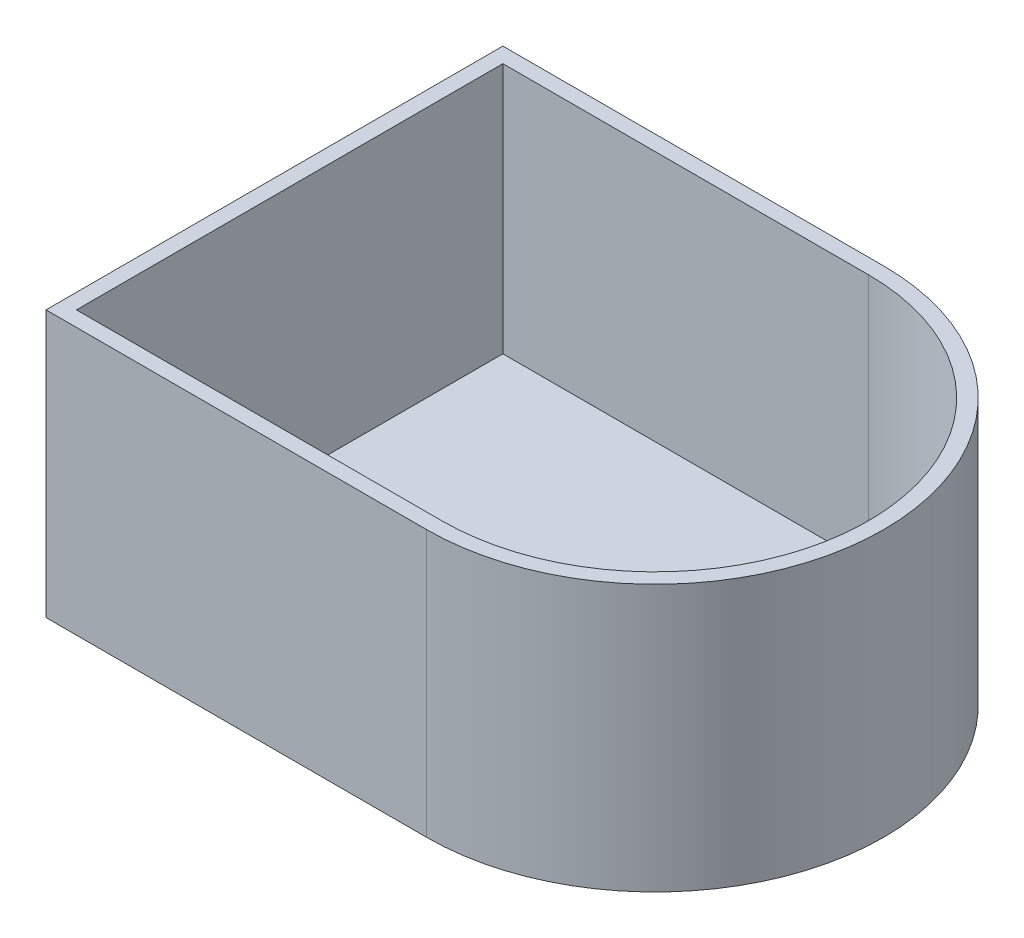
from build123d import *

# Parameters (mm, degrees)
EXTRUDE1_DEPTH = 35
SHELL1_T       = -2


with BuildPart() as part:
    # Sketch1 → Extrude1 (new body)
    with BuildSketch(Plane(origin=(0, 0, 0), x_dir=(1, 0, 0), z_dir=(0, 1, 0))):
        with BuildLine():
            Line((-25, -30), (25, -30))
            ThreePointArc((25, -30), (55, 0), (25, 30))
            Line((25, 30), (-25, 30))
            Line((-25, 30), (-25, -30))
        make_face()
    extrude(amount=EXTRUDE1_DEPTH)

    # Shell1
    shell1_openings = [part.faces().sort_by_distance(p)[0] for p in [
        (12.085713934, 35, 0),
    ]]
    offset(amount=SHELL1_T, openings=shell1_openings, kind=Kind.INTERSECTION)


solid = part.part
